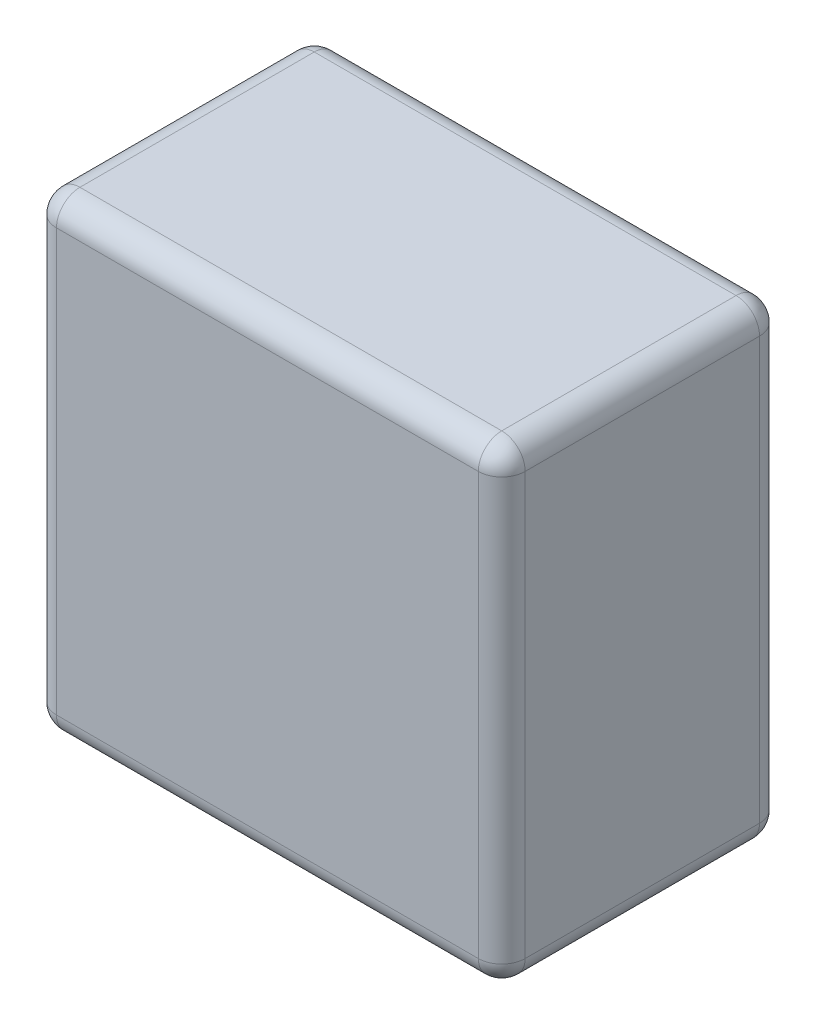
from build123d import *

# Parameters (mm, degrees)
ESQUISSE1_W        = 20
ESQUISSE1_H        = 20
BOSS_EXTRU_1_DEPTH = 12
CONG_1_R           = 1


with BuildPart() as part:
    # Esquisse1 → Boss.-Extru.1 (new body)
    with BuildSketch(Plane.XY):
        with Locations((40, 0)):
            Rectangle(ESQUISSE1_W, ESQUISSE1_H)
    extrude(amount=BOSS_EXTRU_1_DEPTH)

    # Cong_1
    cong_1_edges = [part.edges().sort_by_distance(p)[0] for p in [
        (50, 0, 12),
        (40, 10, 12),
        (30, 0, 12),
        (40, 10, 0),
        (50, 0, 0),
        (40, -10, 0),
        (30, 0, 0),
        (30, 10, 6),
        (50, 10, 6),
        (50, -10, 6),
        (30, -10, 6),
        (40, -10, 12),
    ]]
    fillet(cong_1_edges, radius=CONG_1_R)


solid = part.part
